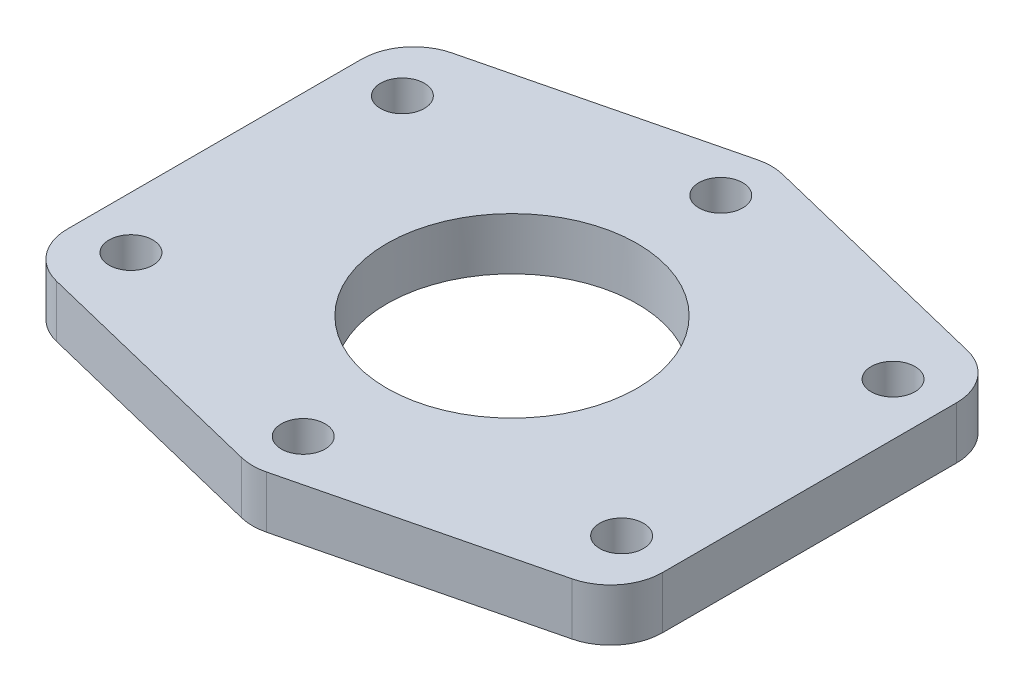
from build123d import *

# Parameters (mm, degrees)
SKETCH_1_W               = 57
SKETCH_1_H               = 36
SKETCH_1_R               = 2.1
EXTRUDE_1_DEPTH          = 5
CUT_EXTRUDE_1_DEPTH      = 35.077118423
CUT_EXTRUDE_1_DEPTH_BACK = 35.077118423
SKETCH_2_R               = 12
EXTRUDE_4_DEPTH          = 5
CUT_EXTRUDE_4_DEPTH      = 39.23937761
CUT_EXTRUDE_4_DEPTH_BACK = 39.23937761
SKETCH_4_R               = 2.1
FILLET_1_R               = 5


with BuildPart() as part:
    # Sketch 1 → Extrude 1 (new body)
    with BuildSketch(Plane(origin=(0, 0, 0), x_dir=(1, 0, 0), z_dir=(0, 1, 0))):
        Rectangle(SKETCH_1_W, SKETCH_1_H)
        with Locations(Location((-23.5, 13, 0), (0, 0, 270))):
            Circle(SKETCH_1_R, mode=Mode.SUBTRACT)
        with Locations(Location((-23.5, -13, 0), (0, 0, 270))):
            Circle(SKETCH_1_R, mode=Mode.SUBTRACT)
        with Locations(Location((23.5, 13, 0), (0, 0, 270))):
            Circle(SKETCH_1_R, mode=Mode.SUBTRACT)
        with Locations(Location((23.5, -13, 0), (0, 0, 270))):
            Circle(SKETCH_1_R, mode=Mode.SUBTRACT)
    extrude(amount=EXTRUDE_1_DEPTH)

    # Sketch 2 → Cut-Extrude 1 (cut, two sides: drawn at the far end of the back side and taken through both)
    with BuildSketch(Plane(origin=(0, 5, 0), x_dir=(1, 0, 0), z_dir=(0, 1, 0)).offset(-CUT_EXTRUDE_1_DEPTH_BACK)):
        with Locations(Location((0, 0, 0), (0, 0, 270))):
            Circle(SKETCH_2_R)
    extrude(amount=CUT_EXTRUDE_1_DEPTH + CUT_EXTRUDE_1_DEPTH_BACK, mode=Mode.SUBTRACT)

    # Sketch 3 → Extrude 4 (add)
    with BuildSketch(Plane(origin=(0, 0, 0), x_dir=(1, 0, 0), z_dir=(0, 1, 0))):
        Polygon((-28.5, 18), (0, 25), (28.5, 18), align=None)
        Polygon((-28.5, -18), (0, -25), (28.5, -18), align=None)
    extrude(amount=EXTRUDE_4_DEPTH)

    # Sketch 4 → Cut-Extrude 4 (cut, two sides: drawn at the far end of the back side and taken through both)
    with BuildSketch(Plane(origin=(0, 0, 0), x_dir=(1, 0, 0), z_dir=(0, 1, 0)).offset(-CUT_EXTRUDE_4_DEPTH_BACK)):
        with Locations(Location((0, 20, 0), (0, 0, 90))):
            Circle(SKETCH_4_R)
        with Locations(Location((0, -20, 0), (0, 0, 90))):
            Circle(SKETCH_4_R)
    extrude(amount=CUT_EXTRUDE_4_DEPTH + CUT_EXTRUDE_4_DEPTH_BACK, mode=Mode.SUBTRACT)

    # Fillet 1
    fillet_1_edges = [part.edges().sort_by_distance(p)[0] for p in [
        (0, 2.5, -25),
        (0, 2.5, 25),
        (28.5, 2.5, 18),
        (-28.5, 2.5, 18),
        (-28.5, 2.5, -18),
        (28.5, 2.5, -18),
    ]]
    fillet(fillet_1_edges, radius=FILLET_1_R)


solid = part.part
